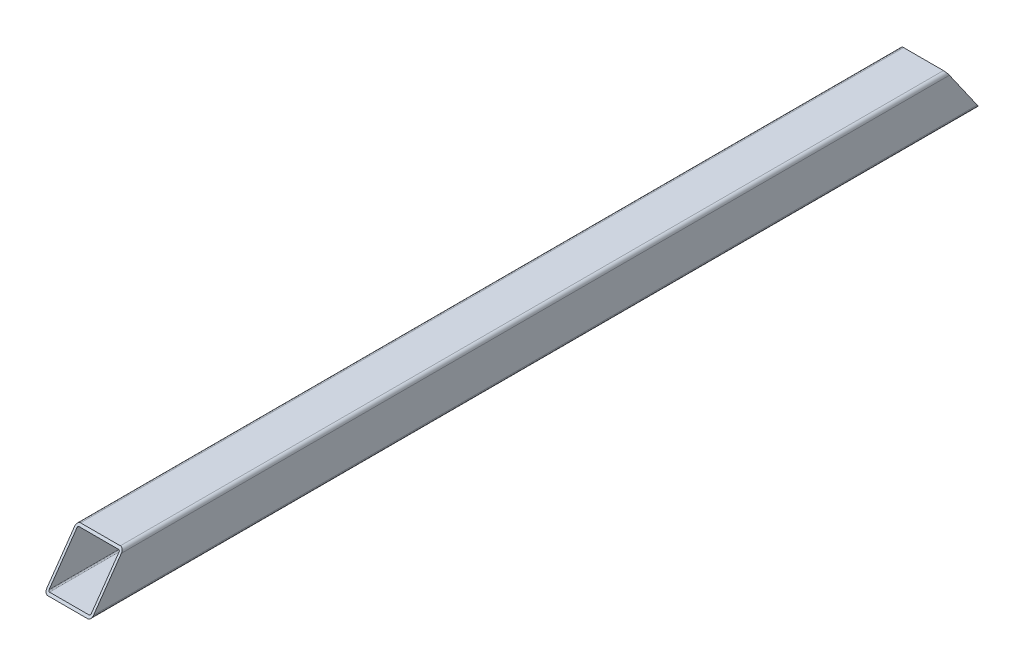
ISO-10303-21;
HEADER;
FILE_DESCRIPTION(('STEP AP214'),'2;1');
FILE_NAME('part.step','',(''),(''),'','','');
FILE_SCHEMA(('AUTOMOTIVE_DESIGN { 1 0 10303 214 1 1 1 1 }'));
ENDSEC;
DATA;
#1=APPLICATION_CONTEXT('core data for automotive mechanical design processes');
#2=APPLICATION_PROTOCOL_DEFINITION('international standard','automotive_design',2000,#1);
#3=PRODUCT_CONTEXT('',#1,'mechanical');
#4=PRODUCT('Part','Part','',(#3));
#5=PRODUCT_RELATED_PRODUCT_CATEGORY('part','',(#4));
#6=PRODUCT_DEFINITION_FORMATION('','',#4);
#7=PRODUCT_DEFINITION_CONTEXT('part definition',#1,'design');
#8=PRODUCT_DEFINITION('design','',#6,#7);
#9=PRODUCT_DEFINITION_SHAPE('','',#8);
#10=(LENGTH_UNIT() NAMED_UNIT(*) SI_UNIT(.MILLI.,.METRE.));
#11=(NAMED_UNIT(*) PLANE_ANGLE_UNIT() SI_UNIT($,.RADIAN.));
#12=(NAMED_UNIT(*) SI_UNIT($,.STERADIAN.) SOLID_ANGLE_UNIT());
#13=UNCERTAINTY_MEASURE_WITH_UNIT(LENGTH_MEASURE(1.E-05),#10,'distance_accuracy_value','');
#14=(GEOMETRIC_REPRESENTATION_CONTEXT(3) GLOBAL_UNCERTAINTY_ASSIGNED_CONTEXT((#13)) GLOBAL_UNIT_ASSIGNED_CONTEXT((#10,
#11,#12)) REPRESENTATION_CONTEXT('',''));
#15=CARTESIAN_POINT('',(0.,0.,0.));
#16=DIRECTION('',(0.,0.,1.));
#17=DIRECTION('',(1.,0.,0.));
#18=AXIS2_PLACEMENT_3D('',#15,#16,#17);
#19=CARTESIAN_POINT('',(3.,-3.,760.));
#20=DIRECTION('',(0.,0.,-1.));
#21=DIRECTION('',(-1.,0.,0.));
#22=AXIS2_PLACEMENT_3D('',#19,#20,#21);
#23=CYLINDRICAL_SURFACE('',#22,3.);
#24=DIRECTION('',(0.,0.,-1.));
#25=VECTOR('',#24,1.);
#26=CARTESIAN_POINT('',(0.,-3.00000000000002,760.));
#27=LINE('',#26,#25);
#28=CARTESIAN_POINT('',(0.,-3.00000000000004,734.092321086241));
#29=VERTEX_POINT('',#28);
#30=CARTESIAN_POINT('',(0.,-3.00000000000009,25.9076789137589));
#31=VERTEX_POINT('',#30);
#32=EDGE_CURVE('E152',#29,#31,#27,.T.);
#33=ORIENTED_EDGE('',*,*,#32,.F.);
#34=CARTESIAN_POINT('',(3.,-3.,734.092321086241));
#35=DIRECTION('',(0.,-0.573576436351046,-0.819152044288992));
#36=DIRECTION('',(0.,0.819152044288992,-0.573576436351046));
#37=AXIS2_PLACEMENT_3D('',#34,#35,#36);
#38=ELLIPSE('',#37,3.66232376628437,3.);
#39=CARTESIAN_POINT('',(3.00000000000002,0.,731.991698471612));
#40=VERTEX_POINT('',#39);
#41=EDGE_CURVE('E136',#29,#40,#38,.T.);
#42=ORIENTED_EDGE('',*,*,#41,.T.);
#43=DIRECTION('',(0.,0.,-1.));
#44=VECTOR('',#43,1.);
#45=CARTESIAN_POINT('',(3.00000000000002,0.,760.));
#46=LINE('',#45,#44);
#47=CARTESIAN_POINT('',(3.00000000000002,0.,28.0083015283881));
#48=VERTEX_POINT('',#47);
#49=EDGE_CURVE('E176',#40,#48,#46,.T.);
#50=ORIENTED_EDGE('',*,*,#49,.T.);
#51=CARTESIAN_POINT('',(3.,-3.,25.9076789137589));
#52=DIRECTION('',(0.,-0.573576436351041,0.819152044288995));
#53=DIRECTION('',(0.,-0.819152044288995,-0.573576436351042));
#54=AXIS2_PLACEMENT_3D('',#51,#52,#53);
#55=ELLIPSE('',#54,3.66232376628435,3.);
#56=EDGE_CURVE('E159',#48,#31,#55,.T.);
#57=ORIENTED_EDGE('',*,*,#56,.T.);
#58=EDGE_LOOP('',(#33,#42,#50,#57));
#59=FACE_BOUND('',#58,.T.);
#60=ADVANCED_FACE('F27',(#59),#23,.T.);
#61=CARTESIAN_POINT('',(0.,-3.00000000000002,760.));
#62=DIRECTION('',(1.,0.,0.));
#63=DIRECTION('',(0.,1.,0.));
#64=AXIS2_PLACEMENT_3D('',#61,#62,#63);
#65=PLANE('',#64);
#66=DIRECTION('',(0.,0.,-1.));
#67=VECTOR('',#66,1.);
#68=CARTESIAN_POINT('',(0.,-37.,760.));
#69=LINE('',#68,#67);
#70=CARTESIAN_POINT('',(0.,-37.,757.899377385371));
#71=VERTEX_POINT('',#70);
#72=CARTESIAN_POINT('',(0.,-37.,2.10062261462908));
#73=VERTEX_POINT('',#72);
#74=EDGE_CURVE('E154',#71,#73,#69,.T.);
#75=ORIENTED_EDGE('',*,*,#74,.F.);
#76=DIRECTION('',(0.,-0.819152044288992,0.573576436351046));
#77=VECTOR('',#76,1.);
#78=CARTESIAN_POINT('',(0.,0.,731.991698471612));
#79=LINE('',#78,#77);
#80=EDGE_CURVE('E139',#29,#71,#79,.T.);
#81=ORIENTED_EDGE('',*,*,#80,.F.);
#82=ORIENTED_EDGE('',*,*,#32,.T.);
#83=DIRECTION('',(0.,0.819152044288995,0.573576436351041));
#84=VECTOR('',#83,1.);
#85=CARTESIAN_POINT('',(0.,-40.,0.));
#86=LINE('',#85,#84);
#87=EDGE_CURVE('E145',#73,#31,#86,.T.);
#88=ORIENTED_EDGE('',*,*,#87,.F.);
#89=EDGE_LOOP('',(#75,#81,#82,#88));
#90=FACE_BOUND('',#89,.T.);
#91=ADVANCED_FACE('F150',(#90),#65,.F.);
#92=CARTESIAN_POINT('',(3.,-37.,760.));
#93=DIRECTION('',(0.,0.,-1.));
#94=DIRECTION('',(-1.,0.,0.));
#95=AXIS2_PLACEMENT_3D('',#92,#93,#94);
#96=CYLINDRICAL_SURFACE('',#95,3.);
#97=DIRECTION('',(0.,0.,-1.));
#98=VECTOR('',#97,1.);
#99=CARTESIAN_POINT('',(3.00000000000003,-40.,760.));
#100=LINE('',#99,#98);
#101=CARTESIAN_POINT('',(3.00000000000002,-40.,760.));
#102=VERTEX_POINT('',#101);
#103=CARTESIAN_POINT('',(3.00000000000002,-40.,0.));
#104=VERTEX_POINT('',#103);
#105=EDGE_CURVE('E162',#102,#104,#100,.T.);
#106=ORIENTED_EDGE('',*,*,#105,.F.);
#107=CARTESIAN_POINT('',(3.,-37.,757.899377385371));
#108=DIRECTION('',(0.,-0.573576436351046,-0.819152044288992));
#109=DIRECTION('',(0.,0.819152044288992,-0.573576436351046));
#110=AXIS2_PLACEMENT_3D('',#107,#108,#109);
#111=ELLIPSE('',#110,3.66232376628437,3.);
#112=EDGE_CURVE('E146',#102,#71,#111,.T.);
#113=ORIENTED_EDGE('',*,*,#112,.T.);
#114=ORIENTED_EDGE('',*,*,#74,.T.);
#115=CARTESIAN_POINT('',(3.,-37.,2.10062261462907));
#116=DIRECTION('',(0.,-0.573576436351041,0.819152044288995));
#117=DIRECTION('',(0.,-0.819152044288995,-0.573576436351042));
#118=AXIS2_PLACEMENT_3D('',#115,#116,#117);
#119=ELLIPSE('',#118,3.66232376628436,3.);
#120=EDGE_CURVE('E200',#73,#104,#119,.T.);
#121=ORIENTED_EDGE('',*,*,#120,.T.);
#122=EDGE_LOOP('',(#106,#113,#114,#121));
#123=FACE_BOUND('',#122,.T.);
#124=ADVANCED_FACE('F275',(#123),#96,.T.);
#125=CARTESIAN_POINT('',(3.00000000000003,-40.,760.));
#126=DIRECTION('',(0.,1.,0.));
#127=DIRECTION('',(0.,0.,1.));
#128=AXIS2_PLACEMENT_3D('',#125,#126,#127);
#129=PLANE('',#128);
#130=DIRECTION('',(1.,0.,0.));
#131=VECTOR('',#130,1.);
#132=CARTESIAN_POINT('',(3.00000000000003,-40.,0.));
#133=LINE('',#132,#131);
#134=CARTESIAN_POINT('',(37.,-40.,0.));
#135=VERTEX_POINT('',#134);
#136=EDGE_CURVE('E180',#104,#135,#133,.T.);
#137=ORIENTED_EDGE('',*,*,#136,.T.);
#138=DIRECTION('',(0.,0.,-1.));
#139=VECTOR('',#138,1.);
#140=CARTESIAN_POINT('',(37.,-40.,760.));
#141=LINE('',#140,#139);
#142=CARTESIAN_POINT('',(37.,-40.,760.));
#143=VERTEX_POINT('',#142);
#144=EDGE_CURVE('E167',#143,#135,#141,.T.);
#145=ORIENTED_EDGE('',*,*,#144,.F.);
#146=DIRECTION('',(1.,0.,0.));
#147=VECTOR('',#146,1.);
#148=CARTESIAN_POINT('',(3.00000000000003,-40.,760.));
#149=LINE('',#148,#147);
#150=EDGE_CURVE('E178',#102,#143,#149,.T.);
#151=ORIENTED_EDGE('',*,*,#150,.F.);
#152=ORIENTED_EDGE('',*,*,#105,.T.);
#153=EDGE_LOOP('',(#137,#145,#151,#152));
#154=FACE_BOUND('',#153,.T.);
#155=ADVANCED_FACE('F271',(#154),#129,.F.);
#156=CARTESIAN_POINT('',(37.,-37.,760.));
#157=DIRECTION('',(0.,0.,-1.));
#158=DIRECTION('',(-1.,0.,0.));
#159=AXIS2_PLACEMENT_3D('',#156,#157,#158);
#160=CYLINDRICAL_SURFACE('',#159,3.);
#161=DIRECTION('',(0.,0.,-1.));
#162=VECTOR('',#161,1.);
#163=CARTESIAN_POINT('',(40.,-37.,760.));
#164=LINE('',#163,#162);
#165=CARTESIAN_POINT('',(40.,-37.,757.899377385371));
#166=VERTEX_POINT('',#165);
#167=CARTESIAN_POINT('',(40.,-37.,2.10062261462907));
#168=VERTEX_POINT('',#167);
#169=EDGE_CURVE('E170',#166,#168,#164,.T.);
#170=ORIENTED_EDGE('',*,*,#169,.F.);
#171=CARTESIAN_POINT('',(37.,-37.,757.899377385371));
#172=DIRECTION('',(0.,-0.573576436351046,-0.819152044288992));
#173=DIRECTION('',(0.,0.819152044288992,-0.573576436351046));
#174=AXIS2_PLACEMENT_3D('',#171,#172,#173);
#175=ELLIPSE('',#174,3.66232376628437,3.);
#176=EDGE_CURVE('E238',#166,#143,#175,.T.);
#177=ORIENTED_EDGE('',*,*,#176,.T.);
#178=ORIENTED_EDGE('',*,*,#144,.T.);
#179=CARTESIAN_POINT('',(37.,-37.,2.10062261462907));
#180=DIRECTION('',(0.,-0.573576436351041,0.819152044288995));
#181=DIRECTION('',(0.,-0.819152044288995,-0.573576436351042));
#182=AXIS2_PLACEMENT_3D('',#179,#180,#181);
#183=ELLIPSE('',#182,3.66232376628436,3.);
#184=EDGE_CURVE('E203',#135,#168,#183,.T.);
#185=ORIENTED_EDGE('',*,*,#184,.T.);
#186=EDGE_LOOP('',(#170,#177,#178,#185));
#187=FACE_BOUND('',#186,.T.);
#188=ADVANCED_FACE('F263',(#187),#160,.T.);
#189=CARTESIAN_POINT('',(40.,-3.00000000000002,760.));
#190=DIRECTION('',(-1.,0.,0.));
#191=DIRECTION('',(0.,0.,1.));
#192=AXIS2_PLACEMENT_3D('',#189,#190,#191);
#193=PLANE('',#192);
#194=DIRECTION('',(0.,0.,-1.));
#195=VECTOR('',#194,1.);
#196=CARTESIAN_POINT('',(40.,-3.00000000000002,760.));
#197=LINE('',#196,#195);
#198=CARTESIAN_POINT('',(40.,-3.,734.092321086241));
#199=VERTEX_POINT('',#198);
#200=CARTESIAN_POINT('',(40.,-3.,25.9076789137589));
#201=VERTEX_POINT('',#200);
#202=EDGE_CURVE('E172',#199,#201,#197,.T.);
#203=ORIENTED_EDGE('',*,*,#202,.F.);
#204=DIRECTION('',(0.,-0.819152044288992,0.573576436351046));
#205=VECTOR('',#204,1.);
#206=CARTESIAN_POINT('',(40.,0.,731.991698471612));
#207=LINE('',#206,#205);
#208=EDGE_CURVE('E155',#199,#166,#207,.T.);
#209=ORIENTED_EDGE('',*,*,#208,.T.);
#210=ORIENTED_EDGE('',*,*,#169,.T.);
#211=DIRECTION('',(0.,0.819152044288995,0.573576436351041));
#212=VECTOR('',#211,1.);
#213=CARTESIAN_POINT('',(40.,-40.,0.));
#214=LINE('',#213,#212);
#215=EDGE_CURVE('E233',#168,#201,#214,.T.);
#216=ORIENTED_EDGE('',*,*,#215,.T.);
#217=EDGE_LOOP('',(#203,#209,#210,#216));
#218=FACE_BOUND('',#217,.T.);
#219=ADVANCED_FACE('F260',(#218),#193,.F.);
#220=CARTESIAN_POINT('',(37.,-3.,760.));
#221=DIRECTION('',(0.,0.,-1.));
#222=DIRECTION('',(-1.,0.,0.));
#223=AXIS2_PLACEMENT_3D('',#220,#221,#222);
#224=CYLINDRICAL_SURFACE('',#223,3.);
#225=DIRECTION('',(0.,0.,-1.));
#226=VECTOR('',#225,1.);
#227=CARTESIAN_POINT('',(37.,0.,760.));
#228=LINE('',#227,#226);
#229=CARTESIAN_POINT('',(37.,0.,731.991698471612));
#230=VERTEX_POINT('',#229);
#231=CARTESIAN_POINT('',(37.,0.,28.0083015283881));
#232=VERTEX_POINT('',#231);
#233=EDGE_CURVE('E174',#230,#232,#228,.T.);
#234=ORIENTED_EDGE('',*,*,#233,.F.);
#235=CARTESIAN_POINT('',(37.,-3.,734.092321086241));
#236=DIRECTION('',(0.,-0.573576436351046,-0.819152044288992));
#237=DIRECTION('',(0.,0.819152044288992,-0.573576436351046));
#238=AXIS2_PLACEMENT_3D('',#235,#236,#237);
#239=ELLIPSE('',#238,3.66232376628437,3.);
#240=EDGE_CURVE('E41',#230,#199,#239,.T.);
#241=ORIENTED_EDGE('',*,*,#240,.T.);
#242=ORIENTED_EDGE('',*,*,#202,.T.);
#243=CARTESIAN_POINT('',(37.,-3.,25.9076789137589));
#244=DIRECTION('',(0.,-0.573576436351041,0.819152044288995));
#245=DIRECTION('',(0.,-0.819152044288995,-0.573576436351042));
#246=AXIS2_PLACEMENT_3D('',#243,#244,#245);
#247=ELLIPSE('',#246,3.66232376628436,3.);
#248=EDGE_CURVE('E206',#201,#232,#247,.T.);
#249=ORIENTED_EDGE('',*,*,#248,.T.);
#250=EDGE_LOOP('',(#234,#241,#242,#249));
#251=FACE_BOUND('',#250,.T.);
#252=ADVANCED_FACE('F280',(#251),#224,.T.);
#253=CARTESIAN_POINT('',(3.00000000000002,0.,760.));
#254=DIRECTION('',(0.,-1.,0.));
#255=DIRECTION('',(0.,0.,-1.));
#256=AXIS2_PLACEMENT_3D('',#253,#254,#255);
#257=PLANE('',#256);
#258=ORIENTED_EDGE('',*,*,#49,.F.);
#259=DIRECTION('',(-1.,0.,0.));
#260=VECTOR('',#259,1.);
#261=CARTESIAN_POINT('',(40.,0.,731.991698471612));
#262=LINE('',#261,#260);
#263=EDGE_CURVE('E141',#230,#40,#262,.T.);
#264=ORIENTED_EDGE('',*,*,#263,.F.);
#265=ORIENTED_EDGE('',*,*,#233,.T.);
#266=DIRECTION('',(-1.,0.,0.));
#267=VECTOR('',#266,1.);
#268=CARTESIAN_POINT('',(40.,0.,28.0083015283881));
#269=LINE('',#268,#267);
#270=EDGE_CURVE('E230',#232,#48,#269,.T.);
#271=ORIENTED_EDGE('',*,*,#270,.T.);
#272=EDGE_LOOP('',(#258,#264,#265,#271));
#273=FACE_BOUND('',#272,.T.);
#274=ADVANCED_FACE('F277',(#273),#257,.F.);
#275=CARTESIAN_POINT('',(3.,-3.,760.));
#276=DIRECTION('',(0.,0.,-1.));
#277=DIRECTION('',(-1.,0.,0.));
#278=AXIS2_PLACEMENT_3D('',#275,#276,#277);
#279=CYLINDRICAL_SURFACE('',#278,1.);
#280=CARTESIAN_POINT('',(3.,-3.,734.092321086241));
#281=DIRECTION('',(0.,-0.573576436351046,-0.819152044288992));
#282=DIRECTION('',(0.,0.819152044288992,-0.573576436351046));
#283=AXIS2_PLACEMENT_3D('',#280,#281,#282);
#284=ELLIPSE('',#283,1.22077458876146,1.);
#285=CARTESIAN_POINT('',(2.,-3.00000000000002,734.092321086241));
#286=VERTEX_POINT('',#285);
#287=CARTESIAN_POINT('',(3.00000000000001,-2.,733.392113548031));
#288=VERTEX_POINT('',#287);
#289=EDGE_CURVE('E48',#286,#288,#284,.T.);
#290=ORIENTED_EDGE('',*,*,#289,.F.);
#291=DIRECTION('',(0.,0.,-1.));
#292=VECTOR('',#291,1.);
#293=CARTESIAN_POINT('',(2.,-3.00000000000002,760.));
#294=LINE('',#293,#292);
#295=CARTESIAN_POINT('',(2.,-3.00000000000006,25.9076789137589));
#296=VERTEX_POINT('',#295);
#297=EDGE_CURVE('E183',#286,#296,#294,.T.);
#298=ORIENTED_EDGE('',*,*,#297,.T.);
#299=CARTESIAN_POINT('',(3.,-3.,25.9076789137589));
#300=DIRECTION('',(0.,-0.573576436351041,0.819152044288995));
#301=DIRECTION('',(0.,-0.819152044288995,-0.573576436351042));
#302=AXIS2_PLACEMENT_3D('',#299,#300,#301);
#303=ELLIPSE('',#302,1.22077458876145,1.);
#304=CARTESIAN_POINT('',(3.00000000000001,-2.,26.6078864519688));
#305=VERTEX_POINT('',#304);
#306=EDGE_CURVE('E209',#305,#296,#303,.T.);
#307=ORIENTED_EDGE('',*,*,#306,.F.);
#308=DIRECTION('',(0.,0.,-1.));
#309=VECTOR('',#308,1.);
#310=CARTESIAN_POINT('',(3.00000000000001,-2.,760.));
#311=LINE('',#310,#309);
#312=EDGE_CURVE('E197',#288,#305,#311,.T.);
#313=ORIENTED_EDGE('',*,*,#312,.F.);
#314=EDGE_LOOP('',(#290,#298,#307,#313));
#315=FACE_BOUND('',#314,.T.);
#316=ADVANCED_FACE('F287',(#315),#279,.F.);
#317=CARTESIAN_POINT('',(2.,-3.00000000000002,760.));
#318=DIRECTION('',(1.,0.,0.));
#319=DIRECTION('',(0.,1.,0.));
#320=AXIS2_PLACEMENT_3D('',#317,#318,#319);
#321=PLANE('',#320);
#322=DIRECTION('',(0.,0.819152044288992,-0.573576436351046));
#323=VECTOR('',#322,1.);
#324=CARTESIAN_POINT('',(2.,-15.1726273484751,742.615686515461));
#325=LINE('',#324,#323);
#326=CARTESIAN_POINT('',(2.,-37.,757.899377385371));
#327=VERTEX_POINT('',#326);
#328=EDGE_CURVE('E243',#327,#286,#325,.T.);
#329=ORIENTED_EDGE('',*,*,#328,.F.);
#330=DIRECTION('',(0.,0.,-1.));
#331=VECTOR('',#330,1.);
#332=CARTESIAN_POINT('',(2.,-37.,760.));
#333=LINE('',#332,#331);
#334=CARTESIAN_POINT('',(2.,-37.,2.10062261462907));
#335=VERTEX_POINT('',#334);
#336=EDGE_CURVE('E185',#327,#335,#333,.T.);
#337=ORIENTED_EDGE('',*,*,#336,.T.);
#338=DIRECTION('',(0.,-0.819152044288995,-0.573576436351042));
#339=VECTOR('',#338,1.);
#340=CARTESIAN_POINT('',(1.99999999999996,341.910568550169,267.416659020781));
#341=LINE('',#340,#339);
#342=EDGE_CURVE('E212',#296,#335,#341,.T.);
#343=ORIENTED_EDGE('',*,*,#342,.F.);
#344=ORIENTED_EDGE('',*,*,#297,.F.);
#345=EDGE_LOOP('',(#329,#337,#343,#344));
#346=FACE_BOUND('',#345,.T.);
#347=ADVANCED_FACE('F362',(#346),#321,.T.);
#348=CARTESIAN_POINT('',(3.,-37.,760.));
#349=DIRECTION('',(0.,0.,-1.));
#350=DIRECTION('',(-1.,0.,0.));
#351=AXIS2_PLACEMENT_3D('',#348,#349,#350);
#352=CYLINDRICAL_SURFACE('',#351,1.);
#353=CARTESIAN_POINT('',(3.,-37.,757.899377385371));
#354=DIRECTION('',(0.,-0.573576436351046,-0.819152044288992));
#355=DIRECTION('',(0.,0.819152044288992,-0.573576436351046));
#356=AXIS2_PLACEMENT_3D('',#353,#354,#355);
#357=ELLIPSE('',#356,1.22077458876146,1.);
#358=CARTESIAN_POINT('',(3.00000000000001,-38.,758.599584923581));
#359=VERTEX_POINT('',#358);
#360=EDGE_CURVE('E245',#359,#327,#357,.T.);
#361=ORIENTED_EDGE('',*,*,#360,.F.);
#362=DIRECTION('',(0.,0.,-1.));
#363=VECTOR('',#362,1.);
#364=CARTESIAN_POINT('',(3.00000000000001,-38.,760.));
#365=LINE('',#364,#363);
#366=CARTESIAN_POINT('',(3.00000000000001,-38.,1.40041507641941));
#367=VERTEX_POINT('',#366);
#368=EDGE_CURVE('E187',#359,#367,#365,.T.);
#369=ORIENTED_EDGE('',*,*,#368,.T.);
#370=CARTESIAN_POINT('',(3.,-37.,2.10062261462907));
#371=DIRECTION('',(0.,-0.573576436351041,0.819152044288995));
#372=DIRECTION('',(0.,-0.819152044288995,-0.573576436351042));
#373=AXIS2_PLACEMENT_3D('',#370,#371,#372);
#374=ELLIPSE('',#373,1.22077458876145,1.);
#375=EDGE_CURVE('E215',#335,#367,#374,.T.);
#376=ORIENTED_EDGE('',*,*,#375,.F.);
#377=ORIENTED_EDGE('',*,*,#336,.F.);
#378=EDGE_LOOP('',(#361,#369,#376,#377));
#379=FACE_BOUND('',#378,.T.);
#380=ADVANCED_FACE('F358',(#379),#352,.F.);
#381=CARTESIAN_POINT('',(3.00000000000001,-38.,760.));
#382=DIRECTION('',(0.,1.,0.));
#383=DIRECTION('',(0.,0.,1.));
#384=AXIS2_PLACEMENT_3D('',#381,#382,#383);
#385=PLANE('',#384);
#386=DIRECTION('',(-1.,0.,0.));
#387=VECTOR('',#386,1.);
#388=CARTESIAN_POINT('',(3.00000000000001,-38.,758.599584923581));
#389=LINE('',#388,#387);
#390=CARTESIAN_POINT('',(37.,-38.,758.599584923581));
#391=VERTEX_POINT('',#390);
#392=EDGE_CURVE('E247',#391,#359,#389,.T.);
#393=ORIENTED_EDGE('',*,*,#392,.F.);
#394=DIRECTION('',(0.,0.,-1.));
#395=VECTOR('',#394,1.);
#396=CARTESIAN_POINT('',(37.,-38.,760.));
#397=LINE('',#396,#395);
#398=CARTESIAN_POINT('',(37.,-38.,1.40041507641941));
#399=VERTEX_POINT('',#398);
#400=EDGE_CURVE('E189',#391,#399,#397,.T.);
#401=ORIENTED_EDGE('',*,*,#400,.T.);
#402=DIRECTION('',(1.,0.,0.));
#403=VECTOR('',#402,1.);
#404=CARTESIAN_POINT('',(2.99999999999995,-38.,1.40041507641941));
#405=LINE('',#404,#403);
#406=EDGE_CURVE('E218',#367,#399,#405,.T.);
#407=ORIENTED_EDGE('',*,*,#406,.F.);
#408=ORIENTED_EDGE('',*,*,#368,.F.);
#409=EDGE_LOOP('',(#393,#401,#407,#408));
#410=FACE_BOUND('',#409,.T.);
#411=ADVANCED_FACE('F354',(#410),#385,.T.);
#412=CARTESIAN_POINT('',(37.,-37.,760.));
#413=DIRECTION('',(0.,0.,-1.));
#414=DIRECTION('',(-1.,0.,0.));
#415=AXIS2_PLACEMENT_3D('',#412,#413,#414);
#416=CYLINDRICAL_SURFACE('',#415,1.);
#417=CARTESIAN_POINT('',(37.,-37.,757.899377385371));
#418=DIRECTION('',(0.,-0.573576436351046,-0.819152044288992));
#419=DIRECTION('',(0.,0.819152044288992,-0.573576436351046));
#420=AXIS2_PLACEMENT_3D('',#417,#418,#419);
#421=ELLIPSE('',#420,1.22077458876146,1.);
#422=CARTESIAN_POINT('',(38.,-37.,757.899377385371));
#423=VERTEX_POINT('',#422);
#424=EDGE_CURVE('E249',#423,#391,#421,.T.);
#425=ORIENTED_EDGE('',*,*,#424,.F.);
#426=DIRECTION('',(0.,0.,-1.));
#427=VECTOR('',#426,1.);
#428=CARTESIAN_POINT('',(38.,-37.,760.));
#429=LINE('',#428,#427);
#430=CARTESIAN_POINT('',(38.,-37.,2.10062261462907));
#431=VERTEX_POINT('',#430);
#432=EDGE_CURVE('E191',#423,#431,#429,.T.);
#433=ORIENTED_EDGE('',*,*,#432,.T.);
#434=CARTESIAN_POINT('',(37.,-37.,2.10062261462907));
#435=DIRECTION('',(0.,-0.573576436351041,0.819152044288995));
#436=DIRECTION('',(0.,-0.819152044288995,-0.573576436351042));
#437=AXIS2_PLACEMENT_3D('',#434,#435,#436);
#438=ELLIPSE('',#437,1.22077458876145,1.);
#439=EDGE_CURVE('E221',#399,#431,#438,.T.);
#440=ORIENTED_EDGE('',*,*,#439,.F.);
#441=ORIENTED_EDGE('',*,*,#400,.F.);
#442=EDGE_LOOP('',(#425,#433,#440,#441));
#443=FACE_BOUND('',#442,.T.);
#444=ADVANCED_FACE('F350',(#443),#416,.F.);
#445=CARTESIAN_POINT('',(38.,-3.00000000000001,760.));
#446=DIRECTION('',(-1.,0.,0.));
#447=DIRECTION('',(0.,0.,1.));
#448=AXIS2_PLACEMENT_3D('',#445,#446,#447);
#449=PLANE('',#448);
#450=DIRECTION('',(0.,-0.819152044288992,0.573576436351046));
#451=VECTOR('',#450,1.);
#452=CARTESIAN_POINT('',(38.,-15.1726273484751,742.615686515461));
#453=LINE('',#452,#451);
#454=CARTESIAN_POINT('',(38.,-3.00000000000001,734.092321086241));
#455=VERTEX_POINT('',#454);
#456=EDGE_CURVE('E251',#455,#423,#453,.T.);
#457=ORIENTED_EDGE('',*,*,#456,.F.);
#458=DIRECTION('',(0.,0.,-1.));
#459=VECTOR('',#458,1.);
#460=CARTESIAN_POINT('',(38.,-3.00000000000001,760.));
#461=LINE('',#460,#459);
#462=CARTESIAN_POINT('',(38.,-3.00000000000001,25.9076789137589));
#463=VERTEX_POINT('',#462);
#464=EDGE_CURVE('E193',#455,#463,#461,.T.);
#465=ORIENTED_EDGE('',*,*,#464,.T.);
#466=DIRECTION('',(0.,0.819152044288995,0.573576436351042));
#467=VECTOR('',#466,1.);
#468=CARTESIAN_POINT('',(38.,341.910568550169,267.416659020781));
#469=LINE('',#468,#467);
#470=EDGE_CURVE('E224',#431,#463,#469,.T.);
#471=ORIENTED_EDGE('',*,*,#470,.F.);
#472=ORIENTED_EDGE('',*,*,#432,.F.);
#473=EDGE_LOOP('',(#457,#465,#471,#472));
#474=FACE_BOUND('',#473,.T.);
#475=ADVANCED_FACE('F328',(#474),#449,.T.);
#476=CARTESIAN_POINT('',(37.,-3.,760.));
#477=DIRECTION('',(0.,0.,-1.));
#478=DIRECTION('',(-1.,0.,0.));
#479=AXIS2_PLACEMENT_3D('',#476,#477,#478);
#480=CYLINDRICAL_SURFACE('',#479,1.);
#481=CARTESIAN_POINT('',(37.,-3.,734.092321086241));
#482=DIRECTION('',(0.,-0.573576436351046,-0.819152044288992));
#483=DIRECTION('',(0.,0.819152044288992,-0.573576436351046));
#484=AXIS2_PLACEMENT_3D('',#481,#482,#483);
#485=ELLIPSE('',#484,1.22077458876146,1.);
#486=CARTESIAN_POINT('',(37.,-2.,733.392113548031));
#487=VERTEX_POINT('',#486);
#488=EDGE_CURVE('E253',#487,#455,#485,.T.);
#489=ORIENTED_EDGE('',*,*,#488,.F.);
#490=DIRECTION('',(0.,0.,-1.));
#491=VECTOR('',#490,1.);
#492=CARTESIAN_POINT('',(37.,-2.,760.));
#493=LINE('',#492,#491);
#494=CARTESIAN_POINT('',(37.,-2.,26.6078864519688));
#495=VERTEX_POINT('',#494);
#496=EDGE_CURVE('E195',#487,#495,#493,.T.);
#497=ORIENTED_EDGE('',*,*,#496,.T.);
#498=CARTESIAN_POINT('',(37.,-3.,25.9076789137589));
#499=DIRECTION('',(0.,-0.573576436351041,0.819152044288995));
#500=DIRECTION('',(0.,-0.819152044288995,-0.573576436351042));
#501=AXIS2_PLACEMENT_3D('',#498,#499,#500);
#502=ELLIPSE('',#501,1.22077458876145,1.);
#503=EDGE_CURVE('E227',#463,#495,#502,.T.);
#504=ORIENTED_EDGE('',*,*,#503,.F.);
#505=ORIENTED_EDGE('',*,*,#464,.F.);
#506=EDGE_LOOP('',(#489,#497,#504,#505));
#507=FACE_BOUND('',#506,.T.);
#508=ADVANCED_FACE('F322',(#507),#480,.F.);
#509=CARTESIAN_POINT('',(3.00000000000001,-2.,760.));
#510=DIRECTION('',(0.,-1.,0.));
#511=DIRECTION('',(0.,0.,-1.));
#512=AXIS2_PLACEMENT_3D('',#509,#510,#511);
#513=PLANE('',#512);
#514=DIRECTION('',(1.,0.,0.));
#515=VECTOR('',#514,1.);
#516=CARTESIAN_POINT('',(3.00000000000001,-2.,733.392113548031));
#517=LINE('',#516,#515);
#518=EDGE_CURVE('E11',#288,#487,#517,.T.);
#519=ORIENTED_EDGE('',*,*,#518,.F.);
#520=ORIENTED_EDGE('',*,*,#312,.T.);
#521=DIRECTION('',(-1.,0.,0.));
#522=VECTOR('',#521,1.);
#523=CARTESIAN_POINT('',(2.99999999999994,-2.,26.6078864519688));
#524=LINE('',#523,#522);
#525=EDGE_CURVE('E34',#495,#305,#524,.T.);
#526=ORIENTED_EDGE('',*,*,#525,.F.);
#527=ORIENTED_EDGE('',*,*,#496,.F.);
#528=EDGE_LOOP('',(#519,#520,#526,#527));
#529=FACE_BOUND('',#528,.T.);
#530=ADVANCED_FACE('F327',(#529),#513,.T.);
#531=CARTESIAN_POINT('',(40.,-40.,0.));
#532=DIRECTION('',(0.,-0.573576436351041,0.819152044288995));
#533=DIRECTION('',(0.,-0.819152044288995,-0.573576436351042));
#534=AXIS2_PLACEMENT_3D('',#531,#532,#533);
#535=PLANE('',#534);
#536=ORIENTED_EDGE('',*,*,#306,.T.);
#537=ORIENTED_EDGE('',*,*,#342,.T.);
#538=ORIENTED_EDGE('',*,*,#375,.T.);
#539=ORIENTED_EDGE('',*,*,#406,.T.);
#540=ORIENTED_EDGE('',*,*,#439,.T.);
#541=ORIENTED_EDGE('',*,*,#470,.T.);
#542=ORIENTED_EDGE('',*,*,#503,.T.);
#543=ORIENTED_EDGE('',*,*,#525,.T.);
#544=EDGE_LOOP('',(#536,#537,#538,#539,#540,#541,#542,#543));
#545=FACE_BOUND('',#544,.T.);
#546=ORIENTED_EDGE('',*,*,#270,.F.);
#547=ORIENTED_EDGE('',*,*,#248,.F.);
#548=ORIENTED_EDGE('',*,*,#215,.F.);
#549=ORIENTED_EDGE('',*,*,#184,.F.);
#550=ORIENTED_EDGE('',*,*,#136,.F.);
#551=ORIENTED_EDGE('',*,*,#120,.F.);
#552=ORIENTED_EDGE('',*,*,#87,.T.);
#553=ORIENTED_EDGE('',*,*,#56,.F.);
#554=EDGE_LOOP('',(#546,#547,#548,#549,#550,#551,#552,#553));
#555=FACE_BOUND('',#554,.T.);
#556=ADVANCED_FACE('F267',(#545,#555),#535,.F.);
#557=CARTESIAN_POINT('',(40.,0.,731.991698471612));
#558=DIRECTION('',(0.,-0.573576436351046,-0.819152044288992));
#559=DIRECTION('',(0.,0.819152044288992,-0.573576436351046));
#560=AXIS2_PLACEMENT_3D('',#557,#558,#559);
#561=PLANE('',#560);
#562=ORIENTED_EDGE('',*,*,#289,.T.);
#563=ORIENTED_EDGE('',*,*,#518,.T.);
#564=ORIENTED_EDGE('',*,*,#488,.T.);
#565=ORIENTED_EDGE('',*,*,#456,.T.);
#566=ORIENTED_EDGE('',*,*,#424,.T.);
#567=ORIENTED_EDGE('',*,*,#392,.T.);
#568=ORIENTED_EDGE('',*,*,#360,.T.);
#569=ORIENTED_EDGE('',*,*,#328,.T.);
#570=EDGE_LOOP('',(#562,#563,#564,#565,#566,#567,#568,#569));
#571=FACE_BOUND('',#570,.T.);
#572=ORIENTED_EDGE('',*,*,#80,.T.);
#573=ORIENTED_EDGE('',*,*,#112,.F.);
#574=ORIENTED_EDGE('',*,*,#150,.T.);
#575=ORIENTED_EDGE('',*,*,#176,.F.);
#576=ORIENTED_EDGE('',*,*,#208,.F.);
#577=ORIENTED_EDGE('',*,*,#240,.F.);
#578=ORIENTED_EDGE('',*,*,#263,.T.);
#579=ORIENTED_EDGE('',*,*,#41,.F.);
#580=EDGE_LOOP('',(#572,#573,#574,#575,#576,#577,#578,#579));
#581=FACE_BOUND('',#580,.T.);
#582=ADVANCED_FACE('F138',(#571,#581),#561,.F.);
#583=CLOSED_SHELL('',(#60,#91,#124,#155,#188,#219,#252,#274,#316,#347,#380,#411,#444,#475,#508,
#530,#556,#582));
#584=MANIFOLD_SOLID_BREP('B2',#583);
#585=ADVANCED_BREP_SHAPE_REPRESENTATION('',(#18,#584),#14);
#586=SHAPE_DEFINITION_REPRESENTATION(#9,#585);
ENDSEC;
END-ISO-10303-21;
